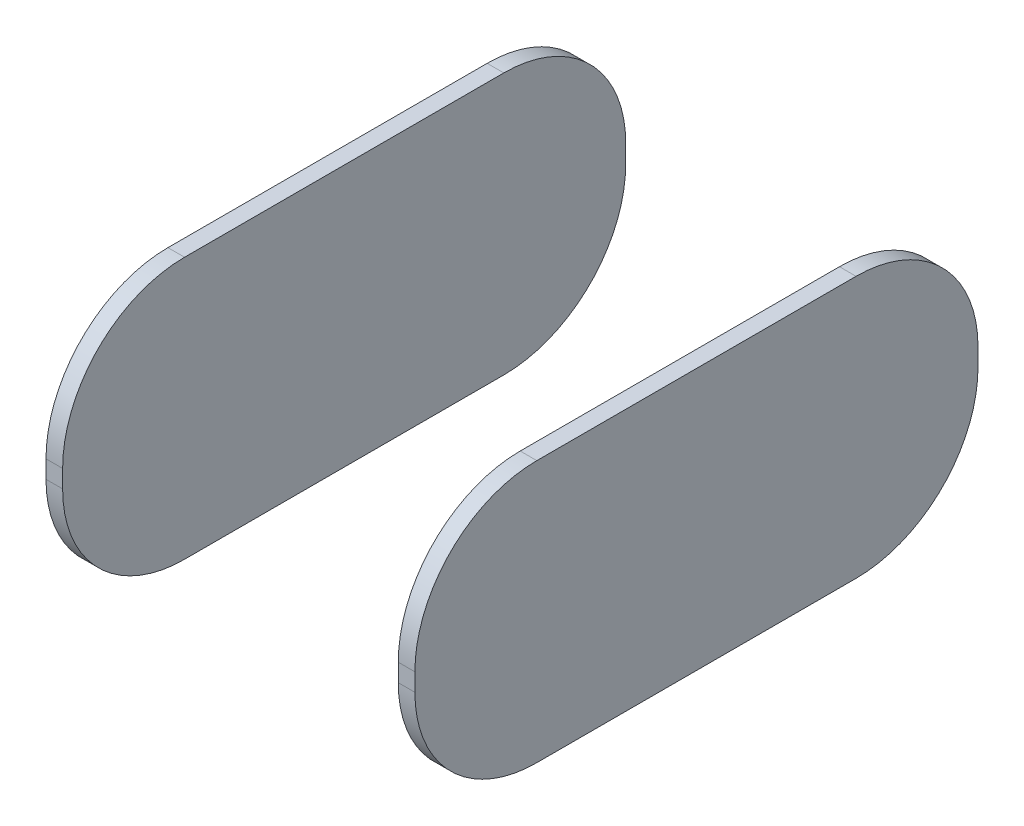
from build123d import *

# Parameters (mm, degrees)
ESQUISSE1_W        = 0.75
ESQUISSE1_H        = 11.8
EXTRUSION1_DEPTH   = 12.7
EXTRUSION1_2_DEPTH = 12.7
CONG_1_R           = 5.5
CONG_2_R           = 5.5


with BuildPart() as part:
    # Esquisse1 → Extrusion1 (new, symmetric)
    with BuildSketch(Plane.XY):
        with Locations((-7.945, 0)):
            Rectangle(ESQUISSE1_W, ESQUISSE1_H)
    extrude(amount=EXTRUSION1_DEPTH, both=True)

    # Cong_1
    cong_1_edges = [part.edges().sort_by_distance(p)[0] for p in [
        (-7.945, 5.9, 12.7),
        (-7.945, 5.9, -12.7),
        (-7.945, -5.9, -12.7),
        (-7.945, -5.9, 12.7),
    ]]
    fillet(cong_1_edges, radius=CONG_1_R)


with BuildPart() as body_2:
    # Esquisse1 → Extrusion1 2 (new, symmetric)
    with BuildSketch(Plane.XY):
        with Locations((7.945, 0)):
            Rectangle(ESQUISSE1_W, ESQUISSE1_H)
    extrude(amount=EXTRUSION1_2_DEPTH, both=True)

    # Cong_2
    cong_2_edges = [body_2.edges().sort_by_distance(p)[0] for p in [
        (7.945, 5.9, 12.7),
        (7.945, 5.9, -12.7),
        (7.945, -5.9, -12.7),
        (7.945, -5.9, 12.7),
    ]]
    fillet(cong_2_edges, radius=CONG_2_R)


solid = Compound([part.part, body_2.part])
